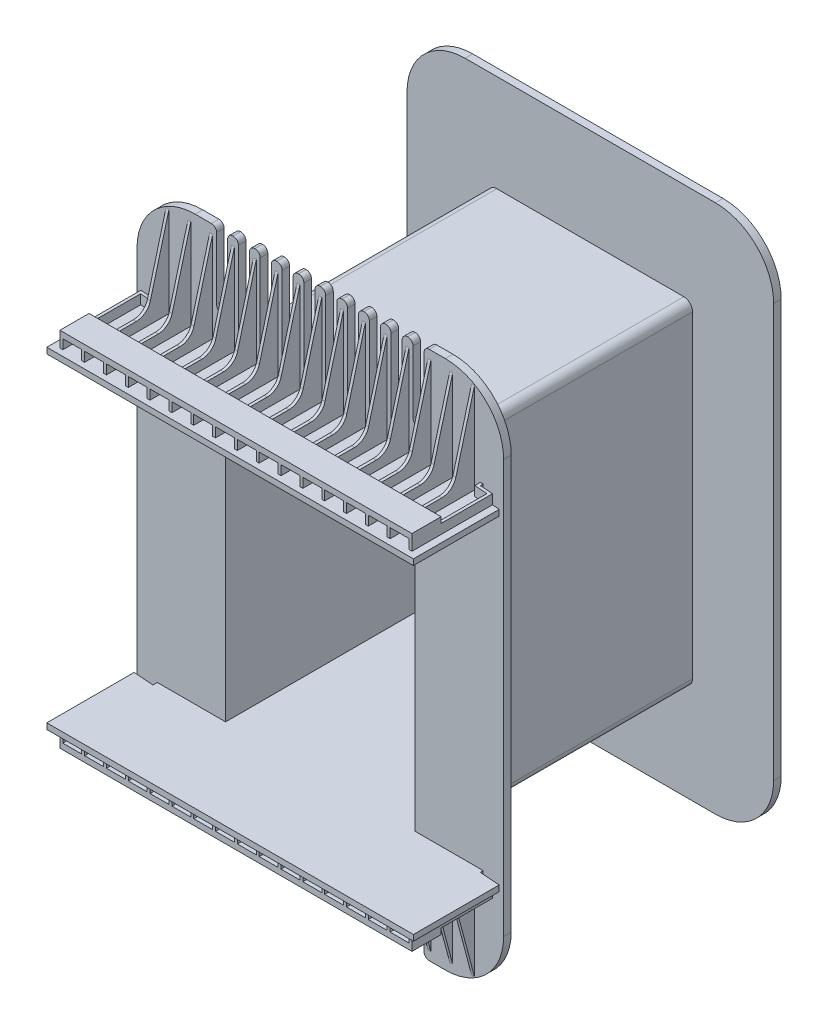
from build123d import *

# Parameters (mm, degrees)
SKIZZE1_W                             = 126
SKIZZE1_H                             = 182
LINEAR_AUSTRAGEN1_DEPTH               = 2.6
SKIZZE2_W                             = 112
SKIZZE2_H                             = 3.9
LINEAR_AUSTRAGEN2_DEPTH               = 2.9
SKIZZE3_W                             = 78
SKIZZE3_H                             = 3.9
LINEAR_AUSTRAGEN3_DEPTH               = 3.1
SKIZZE4_W                             = 3.15
SKIZZE4_H                             = 6
SKIZZE4_H_2                           = 2.9
LINEAR_AUSTRAGEN4_DEPTH               = 27.8
SKIZZE5_W                             = 3.5
SKIZZE5_H                             = 6
SKIZZE5_H_2                           = 2.9
LINEAR_AUSTRAGEN5_DEPTH               = 27.8
SCHNITT_LINEAR_AUSTRAGEN1_REACH       = 206.11
SCHNITT_LINEAR_AUSTRAGEN2_REACH       = 215.003
SCHNITT_LINEAR_AUSTRAGEN3_REACH       = 215.003
SCHNITT_LINEAR_AUSTRAGEN4_REACH       = 214.46
SCHNITT_LINEAR_AUSTRAGEN5_REACH       = 205.795
SCHNITT_LINEAR_AUSTRAGEN6_REACH       = 214.46
SKIZZE12_W                            = 70.3
SKIZZE12_H                            = 115.2
LINEAR_AUSTRAGEN6_DEPTH               = 90.2
SKIZZE13_W                            = 126
SKIZZE13_H                            = 182
LINEAR_AUSTRAGEN7_DEPTH               = 2.6
SKIZZE14_W                            = 65.1
SKIZZE14_H                            = 109.8
SCHNITT_LINEAR_AUSTRAGEN7_DEPTH       = 244.47886972
SKIZZE15_W                            = 126
SKIZZE15_H                            = 2
LINEAR_AUSTRAGEN8_DEPTH               = 31
SKIZZE16_W                            = 1
SKIZZE16_H                            = 29
LINEAR_AUSTRAGEN9_DEPTH               = 3.3
SKIZZE18_W                            = 1
SKIZZE18_H                            = 29
LINEAR_AUSTRAGEN10_DEPTH              = 3.3
SKIZZE19_W                            = 121
SKIZZE19_H                            = 10
LINEAR_AUSTRAGEN11_DEPTH              = 2
SKIZZE20_W                            = 121
SKIZZE20_H                            = 10
LINEAR_AUSTRAGEN12_DEPTH              = 2
SKIZZE21_W                            = 1
SKIZZE21_H                            = 7.4
LINEAR_AUSTRAGEN13_DEPTH              = 27.8
SCHNITT_LINEAR_AUSTRAGEN8_DEPTH       = 251.113894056
SKIZZE23_W                            = 1
SKIZZE23_H                            = 7.4
LINEAR_AUSTRAGEN14_DEPTH              = 27.8
SCHNITT_LINEAR_AUSTRAGEN9_DEPTH       = 251.113894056
SKIZZE25_W                            = 3.8
SKIZZE25_H                            = 31
SKIZZE25_H_2                          = 33.4
SKIZZE25_H_3                          = 25
SCHNITT_LINEAR_AUSTRAGEN10_DEPTH      = 2.6
SKIZZE26_W                            = 3.8
SKIZZE26_H                            = 25
SKIZZE26_H_2                          = 33.4
SKIZZE26_H_3                          = 31
SCHNITT_LINEAR_AUSTRAGEN11_DEPTH      = 2.6
VERRUNDUNG1_R                         = 1.8
VERRUNDUNG2_R                         = 20
VERRUNDUNG3_R                         = 3
SCHNITT_LINEAR_AUSTRAGEN12_DEPTH      = 232.791652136
SCHNITT_LINEAR_AUSTRAGEN12_DEPTH_BACK = 232.791652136
LINEAR_AUSTRAGEN15_DEPTH              = 3.3
LINEAR_AUSTRAGEN16_DEPTH              = 3.3
VERRUNDUNG4_R                         = 5


with BuildPart() as part:
    # Skizze1 → Linear austragen1 (new body)
    with BuildSketch(Plane.XY):
        with Locations((63, 91)):
            Rectangle(SKIZZE1_W, SKIZZE1_H)
    extrude(amount=LINEAR_AUSTRAGEN1_DEPTH)

    # Skizze2 → Linear austragen2 (add)
    with BuildSketch(Plane(origin=(0, 0, 0), x_dir=(-1, 0, 0), z_dir=(0, 0, -1))):
        with Locations((-63, 147.95)):
            Rectangle(SKIZZE2_W, SKIZZE2_H)
        with Locations((-63, 34.05)):
            Rectangle(SKIZZE2_W, SKIZZE2_H)
    extrude(amount=LINEAR_AUSTRAGEN2_DEPTH)

    # Skizze3 → Linear austragen3 (add)
    with BuildSketch(Plane(origin=(0, 0, -2.9), x_dir=(-1, 0, 0), z_dir=(0, 0, -1))):
        with Locations((-63, 147.95)):
            Rectangle(SKIZZE3_W, SKIZZE3_H)
        with Locations((-63, 34.05)):
            Rectangle(SKIZZE3_W, SKIZZE3_H)
    extrude(amount=LINEAR_AUSTRAGEN3_DEPTH)

    # Skizze4 → Linear austragen4 (add)
    with BuildSketch(Plane(origin=(0, 149.9, 0), x_dir=(-1, 0, 0), z_dir=(0, 1, 0))):
        with Locations((-54.025, -3)):
            Rectangle(SKIZZE4_W, SKIZZE4_H)
        with Locations((-36.075, -3)):
            Rectangle(SKIZZE4_W, SKIZZE4_H)
        with Locations((-71.975, -3)):
            Rectangle(SKIZZE4_W, SKIZZE4_H)
        with Locations((-89.925, -3)):
            Rectangle(SKIZZE4_W, SKIZZE4_H)
        with Locations((-18.125, -1.45)):
            Rectangle(SKIZZE4_W, SKIZZE4_H_2)
        with Locations((-107.875, -1.45)):
            Rectangle(SKIZZE4_W, SKIZZE4_H_2)
    extrude(amount=LINEAR_AUSTRAGEN4_DEPTH)

    # Skizze5 → Linear austragen5 (add)
    with BuildSketch(Plane.XZ.offset(-32.1)):
        with Locations((53.85, -3)):
            Rectangle(SKIZZE5_W, SKIZZE5_H)
        with Locations((72.15, -3)):
            Rectangle(SKIZZE5_W, SKIZZE5_H)
        with Locations((90.45, -3)):
            Rectangle(SKIZZE5_W, SKIZZE5_H)
        with Locations((35.55, -3)):
            Rectangle(SKIZZE5_W, SKIZZE5_H)
        with Locations((108.75, -1.45)):
            Rectangle(SKIZZE5_W, SKIZZE5_H_2)
        with Locations((17.25, -1.45)):
            Rectangle(SKIZZE5_W, SKIZZE5_H_2)
    extrude(amount=LINEAR_AUSTRAGEN5_DEPTH)

    # Schnitt-Linear austragen1: up to this face of the body (flat: up to its plane)
    schnitt_linear_austragen1_end = Plane(part.part.faces().sort_by_distance((92.2, 18.2, -3))[0])
    # Skizze6 → Schnitt-Linear austragen1 (cut, up to the picked face)
    with BuildSketch(Plane.ZY.offset(-33.8), mode=Mode.PRIVATE) as schnitt_linear_austragen1_sk1:
        Polygon((-6, 32.1), (0, 4.3), (-6, 4.3), align=None)
    schnitt_linear_austragen1_tool1 = split(extrude(schnitt_linear_austragen1_sk1.sketch, amount=-SCHNITT_LINEAR_AUSTRAGEN1_REACH, mode=Mode.PRIVATE), bisect_by=schnitt_linear_austragen1_end, keep=Keep.BOTH, mode=Mode.PRIVATE)
    add(schnitt_linear_austragen1_tool1.solids().sort_by(Axis((33.8, 13.566667, -4), (1, 0, 0)))[0], mode=Mode.SUBTRACT)

    # Skizze7 → Schnitt-Linear austragen2 (cut, up to next)
    with BuildSketch(Plane.ZY.offset(-15.5), mode=Mode.PRIVATE) as schnitt_linear_austragen2_sk1:
        Polygon((-2.9, 32.1), (0, 4.3), (-2.9, 4.3), align=None)
    schnitt_linear_austragen2_tool1 = extrude(schnitt_linear_austragen2_sk1.sketch, amount=-SCHNITT_LINEAR_AUSTRAGEN2_REACH, mode=Mode.PRIVATE) & part.part
    add(schnitt_linear_austragen2_tool1.solids().sort_by_distance((15.5, 13.566667, -1.933333))[0], mode=Mode.SUBTRACT)

    # Skizze8 → Schnitt-Linear austragen3 (cut, up to next)
    with BuildSketch(Plane(origin=(110.5, 0, 0), x_dir=(0, 0, -1), z_dir=(1, 0, 0)), mode=Mode.PRIVATE) as schnitt_linear_austragen3_sk1:
        Polygon((0, 4.3), (2.9, 32.1), (2.9, 4.3), align=None)
    schnitt_linear_austragen3_tool1 = extrude(schnitt_linear_austragen3_sk1.sketch, amount=-SCHNITT_LINEAR_AUSTRAGEN3_REACH, mode=Mode.PRIVATE) & part.part
    add(schnitt_linear_austragen3_tool1.solids().sort_by_distance((110.5, 13.566667, -1.933333))[0], mode=Mode.SUBTRACT)

    # Skizze9 → Schnitt-Linear austragen4 (cut, up to next)
    with BuildSketch(Plane(origin=(109.45, 0, 0), x_dir=(0, 0, -1), z_dir=(1, 0, 0)), mode=Mode.PRIVATE) as schnitt_linear_austragen4_sk1:
        Polygon((2.9, 149.9), (0, 177.7), (2.9, 177.7), align=None)
    schnitt_linear_austragen4_tool1 = extrude(schnitt_linear_austragen4_sk1.sketch, amount=-SCHNITT_LINEAR_AUSTRAGEN4_REACH, mode=Mode.PRIVATE) & part.part
    add(schnitt_linear_austragen4_tool1.solids().sort_by_distance((109.45, 168.433333, -1.933333))[0], mode=Mode.SUBTRACT)

    # Schnitt-Linear austragen5: up to this face of the body (flat: up to its plane)
    schnitt_linear_austragen5_end = Plane(part.part.faces().sort_by_distance((34.5, 163.8, -3))[0])
    # Skizze10 → Schnitt-Linear austragen5 (cut, up to the picked face)
    with BuildSketch(Plane(origin=(91.5, 0, 0), x_dir=(0, 0, -1), z_dir=(1, 0, 0)), mode=Mode.PRIVATE) as schnitt_linear_austragen5_sk1:
        Polygon((0, 177.7), (6, 177.7), (6, 149.9), align=None)
    schnitt_linear_austragen5_tool1 = split(extrude(schnitt_linear_austragen5_sk1.sketch, amount=-SCHNITT_LINEAR_AUSTRAGEN5_REACH, mode=Mode.PRIVATE), bisect_by=schnitt_linear_austragen5_end, keep=Keep.BOTH, mode=Mode.PRIVATE)
    add(schnitt_linear_austragen5_tool1.solids().sort_by(Axis((91.5, 168.433333, -4), (-1, 0, 0)))[0], mode=Mode.SUBTRACT)

    # Skizze11 → Schnitt-Linear austragen6 (cut, up to next)
    with BuildSketch(Plane.ZY.offset(-16.55), mode=Mode.PRIVATE) as schnitt_linear_austragen6_sk1:
        Polygon((-2.9, 149.9), (-2.9, 177.7), (0, 177.7), align=None)
    schnitt_linear_austragen6_tool1 = extrude(schnitt_linear_austragen6_sk1.sketch, amount=-SCHNITT_LINEAR_AUSTRAGEN6_REACH, mode=Mode.PRIVATE) & part.part
    add(schnitt_linear_austragen6_tool1.solids().sort_by_distance((16.55, 168.433333, -1.933333))[0], mode=Mode.SUBTRACT)

    # Skizze12 → Linear austragen6 (add)
    with BuildSketch(Plane.XY.offset(2.6)):
        with Locations((63, 91)):
            Rectangle(SKIZZE12_W, SKIZZE12_H)
    extrude(amount=LINEAR_AUSTRAGEN6_DEPTH)

    # Skizze13 → Linear austragen7 (add)
    with BuildSketch(Plane.XY.offset(92.8)):
        with Locations((63, 91)):
            Rectangle(SKIZZE13_W, SKIZZE13_H)
    extrude(amount=LINEAR_AUSTRAGEN7_DEPTH)

    # Skizze14 → Schnitt-Linear austragen7 (cut, through all)
    with BuildSketch(Plane.XY.offset(95.4)):
        with Locations((63, 91)):
            Rectangle(SKIZZE14_W, SKIZZE14_H)
    extrude(amount=-SCHNITT_LINEAR_AUSTRAGEN7_DEPTH, mode=Mode.SUBTRACT)

    # Skizze15 → Linear austragen8 (add)
    with BuildSketch(Plane.XY.offset(95.4)):
        with Locations((63, 146.9)):
            Rectangle(SKIZZE15_W, SKIZZE15_H)
        with Locations((63, 35.1)):
            Rectangle(SKIZZE15_W, SKIZZE15_H)
    extrude(amount=LINEAR_AUSTRAGEN8_DEPTH)

    # Skizze16 → Linear austragen9 (add)
    with BuildSketch(Plane(origin=(0, 147.9, 0), x_dir=(-1, 0, 0), z_dir=(0, 1, 0))):
        with Locations((-3, 109.9)):
            Rectangle(SKIZZE16_W, SKIZZE16_H)
        with Locations((-10.5, 109.9)):
            Rectangle(SKIZZE16_W, SKIZZE16_H)
        with Locations((-18, 109.9)):
            Rectangle(SKIZZE16_W, SKIZZE16_H)
        with Locations((-25.5, 109.9)):
            Rectangle(SKIZZE16_W, SKIZZE16_H)
        with Locations((-33, 109.9)):
            Rectangle(SKIZZE16_W, SKIZZE16_H)
        with Locations((-40.5, 109.9)):
            Rectangle(SKIZZE16_W, SKIZZE16_H)
        with Locations((-48, 109.9)):
            Rectangle(SKIZZE16_W, SKIZZE16_H)
        with Locations((-55.5, 109.9)):
            Rectangle(SKIZZE16_W, SKIZZE16_H)
        with Locations((-63, 109.9)):
            Rectangle(SKIZZE16_W, SKIZZE16_H)
        with Locations((-70.5, 109.9)):
            Rectangle(SKIZZE16_W, SKIZZE16_H)
        with Locations((-78, 109.9)):
            Rectangle(SKIZZE16_W, SKIZZE16_H)
        with Locations((-85.5, 109.9)):
            Rectangle(SKIZZE16_W, SKIZZE16_H)
        with Locations((-93, 109.9)):
            Rectangle(SKIZZE16_W, SKIZZE16_H)
        with Locations((-100.5, 109.9)):
            Rectangle(SKIZZE16_W, SKIZZE16_H)
        with Locations((-108, 109.9)):
            Rectangle(SKIZZE16_W, SKIZZE16_H)
        with Locations((-115.5, 109.9)):
            Rectangle(SKIZZE16_W, SKIZZE16_H)
        with Locations((-123, 109.9)):
            Rectangle(SKIZZE16_W, SKIZZE16_H)
    extrude(amount=LINEAR_AUSTRAGEN9_DEPTH)

    # Skizze18 → Linear austragen10 (add)
    with BuildSketch(Plane.XZ.offset(-34.1)):
        with Locations((115.5, 109.9)):
            Rectangle(SKIZZE18_W, SKIZZE18_H)
        with Locations((123, 109.9)):
            Rectangle(SKIZZE18_W, SKIZZE18_H)
        with Locations((108, 109.9)):
            Rectangle(SKIZZE18_W, SKIZZE18_H)
        with Locations((100.5, 109.9)):
            Rectangle(SKIZZE18_W, SKIZZE18_H)
        with Locations((93, 109.9)):
            Rectangle(SKIZZE18_W, SKIZZE18_H)
        with Locations((85.5, 109.9)):
            Rectangle(SKIZZE18_W, SKIZZE18_H)
        with Locations((78, 109.9)):
            Rectangle(SKIZZE18_W, SKIZZE18_H)
        with Locations((70.5, 109.9)):
            Rectangle(SKIZZE18_W, SKIZZE18_H)
        with Locations((63, 109.9)):
            Rectangle(SKIZZE18_W, SKIZZE18_H)
        with Locations((55.5, 109.9)):
            Rectangle(SKIZZE18_W, SKIZZE18_H)
        with Locations((48, 109.9)):
            Rectangle(SKIZZE18_W, SKIZZE18_H)
        with Locations((40.5, 109.9)):
            Rectangle(SKIZZE18_W, SKIZZE18_H)
        with Locations((33, 109.9)):
            Rectangle(SKIZZE18_W, SKIZZE18_H)
        with Locations((25.5, 109.9)):
            Rectangle(SKIZZE18_W, SKIZZE18_H)
        with Locations((18, 109.9)):
            Rectangle(SKIZZE18_W, SKIZZE18_H)
        with Locations((10.5, 109.9)):
            Rectangle(SKIZZE18_W, SKIZZE18_H)
        with Locations((3, 109.9)):
            Rectangle(SKIZZE18_W, SKIZZE18_H)
    extrude(amount=LINEAR_AUSTRAGEN10_DEPTH)

    # Skizze19 → Linear austragen11 (add)
    with BuildSketch(Plane.XZ.offset(-30.8)):
        with Locations((63, 119.4)):
            Rectangle(SKIZZE19_W, SKIZZE19_H)
    extrude(amount=LINEAR_AUSTRAGEN11_DEPTH)

    # Skizze20 → Linear austragen12 (add)
    with BuildSketch(Plane(origin=(0, 151.2, 0), x_dir=(-1, 0, 0), z_dir=(0, 1, 0))):
        with Locations((-63, 119.4)):
            Rectangle(SKIZZE20_W, SKIZZE20_H)
    extrude(amount=LINEAR_AUSTRAGEN12_DEPTH)

    # Skizze21 → Linear austragen13 (add)
    with BuildSketch(Plane(origin=(0, 151.2, 0), x_dir=(-1, 0, 0), z_dir=(0, 1, 0))):
        with Locations((-115.5, 99.1)):
            Rectangle(SKIZZE21_W, SKIZZE21_H)
        with Locations((-108, 99.1)):
            Rectangle(SKIZZE21_W, SKIZZE21_H)
        with Locations((-100.5, 99.1)):
            Rectangle(SKIZZE21_W, SKIZZE21_H)
        with Locations((-93, 99.1)):
            Rectangle(SKIZZE21_W, SKIZZE21_H)
        with Locations((-85.5, 99.1)):
            Rectangle(SKIZZE21_W, SKIZZE21_H)
        with Locations((-78, 99.1)):
            Rectangle(SKIZZE21_W, SKIZZE21_H)
        with Locations((-70.5, 99.1)):
            Rectangle(SKIZZE21_W, SKIZZE21_H)
        with Locations((-63, 99.1)):
            Rectangle(SKIZZE21_W, SKIZZE21_H)
        with Locations((-55.5, 99.1)):
            Rectangle(SKIZZE21_W, SKIZZE21_H)
        with Locations((-48, 99.1)):
            Rectangle(SKIZZE21_W, SKIZZE21_H)
        with Locations((-40.5, 99.1)):
            Rectangle(SKIZZE21_W, SKIZZE21_H)
        with Locations((-33, 99.1)):
            Rectangle(SKIZZE21_W, SKIZZE21_H)
        with Locations((-25.5, 99.1)):
            Rectangle(SKIZZE21_W, SKIZZE21_H)
        with Locations((-18, 99.1)):
            Rectangle(SKIZZE21_W, SKIZZE21_H)
        with Locations((-10.5, 99.1)):
            Rectangle(SKIZZE21_W, SKIZZE21_H)
    extrude(amount=LINEAR_AUSTRAGEN13_DEPTH)

    # Skizze22 → Schnitt-Linear austragen8 (cut, through all)
    with BuildSketch(Plane.ZY.offset(-10)):
        Polygon((102.8, 151.2), (95.4, 179), (102.8, 179), align=None)
    extrude(amount=-SCHNITT_LINEAR_AUSTRAGEN8_DEPTH, mode=Mode.SUBTRACT)

    # Skizze23 → Linear austragen14 (add)
    with BuildSketch(Plane.XZ.offset(-30.8)):
        with Locations((10.5, 99.1)):
            Rectangle(SKIZZE23_W, SKIZZE23_H)
        with Locations((18, 99.1)):
            Rectangle(SKIZZE23_W, SKIZZE23_H)
        with Locations((25.5, 99.1)):
            Rectangle(SKIZZE23_W, SKIZZE23_H)
        with Locations((33, 99.1)):
            Rectangle(SKIZZE23_W, SKIZZE23_H)
        with Locations((40.5, 99.1)):
            Rectangle(SKIZZE23_W, SKIZZE23_H)
        with Locations((48, 99.1)):
            Rectangle(SKIZZE23_W, SKIZZE23_H)
        with Locations((55.5, 99.1)):
            Rectangle(SKIZZE23_W, SKIZZE23_H)
        with Locations((63, 99.1)):
            Rectangle(SKIZZE23_W, SKIZZE23_H)
        with Locations((70.5, 99.1)):
            Rectangle(SKIZZE23_W, SKIZZE23_H)
        with Locations((78, 99.1)):
            Rectangle(SKIZZE23_W, SKIZZE23_H)
        with Locations((85.5, 99.1)):
            Rectangle(SKIZZE23_W, SKIZZE23_H)
        with Locations((93, 99.1)):
            Rectangle(SKIZZE23_W, SKIZZE23_H)
        with Locations((100.5, 99.1)):
            Rectangle(SKIZZE23_W, SKIZZE23_H)
        with Locations((108, 99.1)):
            Rectangle(SKIZZE23_W, SKIZZE23_H)
        with Locations((115.5, 99.1)):
            Rectangle(SKIZZE23_W, SKIZZE23_H)
    extrude(amount=LINEAR_AUSTRAGEN14_DEPTH)

    # Skizze24 → Schnitt-Linear austragen9 (cut, through all)
    with BuildSketch(Plane.ZY.offset(-10)):
        Polygon((102.8, 30.8), (95.4, 3), (102.8, 3), align=None)
    extrude(amount=-SCHNITT_LINEAR_AUSTRAGEN9_DEPTH, mode=Mode.SUBTRACT)

    # Skizze25 → Schnitt-Linear austragen10 (cut)
    with BuildSketch(Plane.XY.offset(95.4)):
        with Locations((59.25, 166.5)):
            Rectangle(SKIZZE25_W, SKIZZE25_H)
        with Locations((66.75, 166.5)):
            Rectangle(SKIZZE25_W, SKIZZE25_H)
        with Locations((74.25, 166.5)):
            Rectangle(SKIZZE25_W, SKIZZE25_H)
        with Locations((81.75, 166.5)):
            Rectangle(SKIZZE25_W, SKIZZE25_H)
        with Locations((89.25, 165.3)):
            Rectangle(SKIZZE25_W, SKIZZE25_H_2)
        with Locations((96.75, 169.5)):
            Rectangle(SKIZZE25_W, SKIZZE25_H_3)
        with Locations((51.75, 166.5)):
            Rectangle(SKIZZE25_W, SKIZZE25_H)
        with Locations((44.25, 166.5)):
            Rectangle(SKIZZE25_W, SKIZZE25_H)
        with Locations((36.75, 165.3)):
            Rectangle(SKIZZE25_W, SKIZZE25_H_2)
        with Locations((29.25, 169.5)):
            Rectangle(SKIZZE25_W, SKIZZE25_H_3)
    extrude(amount=-SCHNITT_LINEAR_AUSTRAGEN10_DEPTH, mode=Mode.SUBTRACT)

    # Skizze26 → Schnitt-Linear austragen11 (cut)
    with BuildSketch(Plane.XY.offset(95.4)):
        with Locations((29.25, 12.5)):
            Rectangle(SKIZZE26_W, SKIZZE26_H)
        with Locations((36.75, 16.7)):
            Rectangle(SKIZZE26_W, SKIZZE26_H_2)
        with Locations((44.25, 15.5)):
            Rectangle(SKIZZE26_W, SKIZZE26_H_3)
        with Locations((51.75, 15.5)):
            Rectangle(SKIZZE26_W, SKIZZE26_H_3)
        with Locations((59.25, 15.5)):
            Rectangle(SKIZZE26_W, SKIZZE26_H_3)
        with Locations((66.75, 15.5)):
            Rectangle(SKIZZE26_W, SKIZZE26_H_3)
        with Locations((74.25, 15.5)):
            Rectangle(SKIZZE26_W, SKIZZE26_H_3)
        with Locations((81.75, 15.5)):
            Rectangle(SKIZZE26_W, SKIZZE26_H_3)
        with Locations((89.25, 16.7)):
            Rectangle(SKIZZE26_W, SKIZZE26_H_2)
        with Locations((96.75, 12.5)):
            Rectangle(SKIZZE26_W, SKIZZE26_H)
    extrude(amount=-SCHNITT_LINEAR_AUSTRAGEN11_DEPTH, mode=Mode.SUBTRACT)

    # Verrundung1
    verrundung1_edges = [part.edges().sort_by_distance(p)[0] for p in [
        (119, 147.95, -2.9),
        (57.35, 151, 94.1),
        (57.35, 182, 94.1),
        (61.15, 182, 94.1),
        (61.15, 151, 94.1),
        (64.85, 151, 94.1),
        (64.85, 182, 94.1),
        (68.65, 182, 94.1),
        (68.65, 151, 94.1),
        (7, 147.95, -2.9),
        (72.35, 151, 94.1),
        (72.35, 182, 94.1),
        (76.15, 182, 94.1),
        (76.15, 151, 94.1),
        (79.85, 151, 94.1),
        (79.85, 182, 94.1),
        (83.65, 182, 94.1),
        (83.65, 151, 94.1),
        (87.35, 182, 94.1),
        (91.15, 182, 94.1),
        (94.85, 157, 94.1),
        (94.85, 182, 94.1),
        (98.65, 182, 94.1),
        (98.65, 157, 94.1),
        (49.85, 151, 94.1),
        (49.85, 182, 94.1),
        (53.65, 182, 94.1),
        (53.65, 151, 94.1),
        (42.35, 151, 94.1),
        (42.35, 182, 94.1),
        (46.15, 182, 94.1),
        (46.15, 151, 94.1),
        (34.85, 182, 94.1),
        (38.65, 182, 94.1),
        (27.35, 157, 94.1),
        (27.35, 182, 94.1),
        (31.15, 182, 94.1),
        (31.15, 157, 94.1),
        (27.35, 0, 94.1),
        (27.35, 25, 94.1),
        (31.15, 25, 94.1),
        (31.15, 0, 94.1),
        (34.85, 0, 94.1),
        (38.65, 0, 94.1),
        (42.35, 0, 94.1),
        (42.35, 31, 94.1),
        (46.15, 31, 94.1),
        (46.15, 0, 94.1),
        (49.85, 0, 94.1),
        (49.85, 31, 94.1),
        (53.65, 31, 94.1),
        (53.65, 0, 94.1),
        (57.35, 0, 94.1),
        (57.35, 31, 94.1),
        (61.15, 31, 94.1),
        (61.15, 0, 94.1),
        (64.85, 0, 94.1),
        (64.85, 31, 94.1),
        (68.65, 31, 94.1),
        (68.65, 0, 94.1),
        (72.35, 0, 94.1),
        (72.35, 31, 94.1),
        (76.15, 31, 94.1),
        (76.15, 0, 94.1),
        (79.85, 0, 94.1),
        (79.85, 31, 94.1),
        (83.65, 31, 94.1),
        (83.65, 0, 94.1),
        (87.35, 0, 94.1),
        (91.15, 0, 94.1),
        (94.85, 0, 94.1),
        (94.85, 25, 94.1),
        (98.65, 25, 94.1),
        (98.65, 0, 94.1),
        (119, 34.05, -2.9),
        (7, 34.05, -2.9),
        (102, 147.95, -6),
        (24, 147.95, -6),
        (102, 34.05, -6),
        (24, 34.05, -6),
    ]]
    fillet(verrundung1_edges, radius=VERRUNDUNG1_R)

    # Verrundung2
    verrundung2_edges = [part.edges().sort_by_distance(p)[0] for p in [
        (0, 182, 94.1),
        (0, 0, 94.1),
        (126, 0, 94.1),
        (126, 182, 94.1),
        (0, 182, 1.3),
        (126, 182, 1.3),
        (126, 0, 1.3),
        (0, 0, 1.3),
    ]]
    fillet(verrundung2_edges, radius=VERRUNDUNG2_R)

    # Verrundung3
    verrundung3_edges = [part.edges().sort_by_distance(p)[0] for p in [
        (27.85, 148.6, 47.7),
        (27.85, 33.4, 47.7),
        (98.15, 33.4, 47.7),
        (98.15, 148.6, 47.7),
    ]]
    fillet(verrundung3_edges, radius=VERRUNDUNG3_R)

    # Skizze27 → Schnitt-Linear austragen12 (cut, two sides: drawn at the far end of the back side and taken through both)
    with BuildSketch(Plane(origin=(0, 147.9, 0), x_dir=(-1, 0, 0), z_dir=(0, 1, 0)).offset(-SCHNITT_LINEAR_AUSTRAGEN12_DEPTH_BACK)):
        Polygon((-126, 95.4), (-126, 96.9), (-119, 96.4), (-119, 95.4), align=None)
        Polygon((0, 95.4), (-7, 95.4), (-7, 96.9), (0, 96.4), align=None)
    extrude(amount=SCHNITT_LINEAR_AUSTRAGEN12_DEPTH + SCHNITT_LINEAR_AUSTRAGEN12_DEPTH_BACK, mode=Mode.SUBTRACT)

    # Skizze28 → Linear austragen15 (add)
    with BuildSketch(Plane(origin=(0, 147.9, 0), x_dir=(-1, 0, 0), z_dir=(0, 1, 0))):
        Polygon((-122.5, 96.65), (-122.5, 97.65), (-118, 97.328571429), (-118, 95.4), (-119, 95.4), (-119, 96.4), align=None)
        Polygon((-7, 95.4), (-8, 95.4), (-8, 97.971428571), (-3.5, 97.65), (-3.5, 96.65), (-7, 96.9), align=None)
    extrude(amount=LINEAR_AUSTRAGEN15_DEPTH)

    # Skizze29 → Linear austragen16 (add)
    with BuildSketch(Plane.XZ.offset(-34.1)):
        Polygon((122.5, 97.65), (118, 97.328571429), (118, 95.4), (119, 95.4), (119, 96.4), (122.5, 96.65), align=None)
        Polygon((3.5, 97.65), (8, 97.971428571), (8, 95.4), (7, 95.4), (7, 96.9), (3.5, 96.65), align=None)
    extrude(amount=LINEAR_AUSTRAGEN16_DEPTH)

    # Verrundung4
    verrundung4_edges = [part.edges().sort_by_distance(p)[0] for p in [
        (115.5, 151.2, 102.8),
        (108, 151.2, 102.8),
        (100.5, 151.2, 102.8),
        (93, 151.2, 102.8),
        (85.5, 151.2, 102.8),
        (78, 151.2, 102.8),
        (70.5, 151.2, 102.8),
        (63, 151.2, 102.8),
        (55.5, 151.2, 102.8),
        (48, 151.2, 102.8),
        (40.5, 151.2, 102.8),
        (33, 151.2, 102.8),
        (25.5, 151.2, 102.8),
        (18, 151.2, 102.8),
        (10.5, 151.2, 102.8),
        (10.5, 30.8, 102.8),
        (18, 30.8, 102.8),
        (25.5, 30.8, 102.8),
        (33, 30.8, 102.8),
        (40.5, 30.8, 102.8),
        (48, 30.8, 102.8),
        (55.5, 30.8, 102.8),
        (63, 30.8, 102.8),
        (70.5, 30.8, 102.8),
        (78, 30.8, 102.8),
        (85.5, 30.8, 102.8),
        (93, 30.8, 102.8),
        (100.5, 30.8, 102.8),
        (108, 30.8, 102.8),
        (115.5, 30.8, 102.8),
    ]]
    fillet(verrundung4_edges, radius=VERRUNDUNG4_R)


solid = part.part
